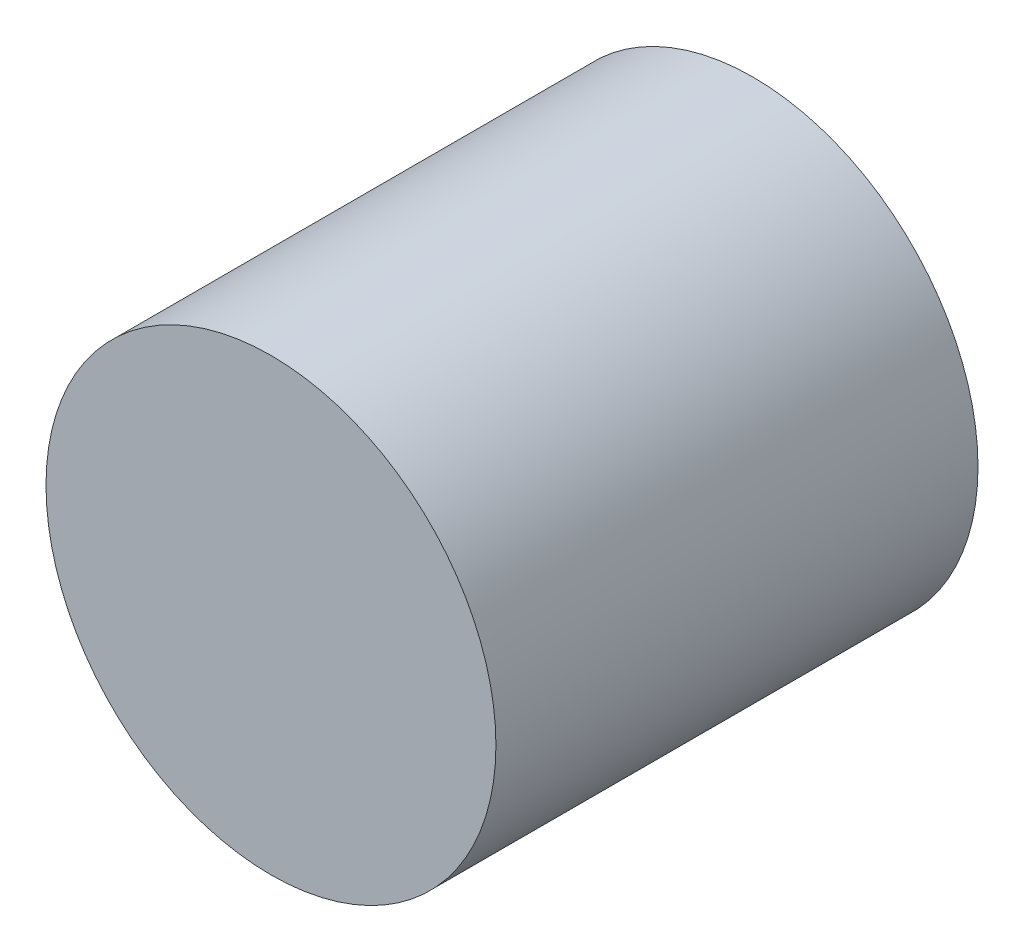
ISO-10303-21;
HEADER;
FILE_DESCRIPTION(('STEP AP214'),'2;1');
FILE_NAME('part.step','',(''),(''),'','','');
FILE_SCHEMA(('AUTOMOTIVE_DESIGN { 1 0 10303 214 1 1 1 1 }'));
ENDSEC;
DATA;
#1=APPLICATION_CONTEXT('core data for automotive mechanical design processes');
#2=APPLICATION_PROTOCOL_DEFINITION('international standard','automotive_design',2000,#1);
#3=PRODUCT_CONTEXT('',#1,'mechanical');
#4=PRODUCT('Part','Part','',(#3));
#5=PRODUCT_RELATED_PRODUCT_CATEGORY('part','',(#4));
#6=PRODUCT_DEFINITION_FORMATION('','',#4);
#7=PRODUCT_DEFINITION_CONTEXT('part definition',#1,'design');
#8=PRODUCT_DEFINITION('design','',#6,#7);
#9=PRODUCT_DEFINITION_SHAPE('','',#8);
#10=(LENGTH_UNIT() NAMED_UNIT(*) SI_UNIT(.MILLI.,.METRE.));
#11=(NAMED_UNIT(*) PLANE_ANGLE_UNIT() SI_UNIT($,.RADIAN.));
#12=(NAMED_UNIT(*) SI_UNIT($,.STERADIAN.) SOLID_ANGLE_UNIT());
#13=UNCERTAINTY_MEASURE_WITH_UNIT(LENGTH_MEASURE(1.E-05),#10,'distance_accuracy_value','');
#14=(GEOMETRIC_REPRESENTATION_CONTEXT(3) GLOBAL_UNCERTAINTY_ASSIGNED_CONTEXT((#13)) GLOBAL_UNIT_ASSIGNED_CONTEXT((#10,
#11,#12)) REPRESENTATION_CONTEXT('',''));
#15=CARTESIAN_POINT('',(0.,0.,0.));
#16=DIRECTION('',(0.,0.,1.));
#17=DIRECTION('',(1.,0.,0.));
#18=AXIS2_PLACEMENT_3D('',#15,#16,#17);
#19=CARTESIAN_POINT('',(0.,0.,7.5));
#20=DIRECTION('',(0.,0.,1.));
#21=DIRECTION('',(1.,0.,0.));
#22=AXIS2_PLACEMENT_3D('',#19,#20,#21);
#23=PLANE('',#22);
#24=CARTESIAN_POINT('',(0.,0.,7.5));
#25=DIRECTION('',(0.,0.,-1.));
#26=DIRECTION('',(-1.,0.,0.));
#27=AXIS2_PLACEMENT_3D('',#24,#25,#26);
#28=CIRCLE('',#27,7.);
#29=CARTESIAN_POINT('',(-7.,0.,7.5));
#30=VERTEX_POINT('',#29);
#31=EDGE_CURVE('E10',#30,#30,#28,.T.);
#32=ORIENTED_EDGE('',*,*,#31,.F.);
#33=EDGE_LOOP('',(#32));
#34=FACE_BOUND('',#33,.T.);
#35=ADVANCED_FACE('F15',(#34),#23,.T.);
#36=CARTESIAN_POINT('',(0.,0.,-7.5));
#37=DIRECTION('',(0.,0.,-1.));
#38=DIRECTION('',(-1.,0.,0.));
#39=AXIS2_PLACEMENT_3D('',#36,#37,#38);
#40=PLANE('',#39);
#41=CARTESIAN_POINT('',(0.,0.,-7.5));
#42=DIRECTION('',(0.,0.,1.));
#43=DIRECTION('',(1.,0.,0.));
#44=AXIS2_PLACEMENT_3D('',#41,#42,#43);
#45=CIRCLE('',#44,7.);
#46=CARTESIAN_POINT('',(7.,0.,-7.5));
#47=VERTEX_POINT('',#46);
#48=EDGE_CURVE('E22',#47,#47,#45,.T.);
#49=ORIENTED_EDGE('',*,*,#48,.F.);
#50=EDGE_LOOP('',(#49));
#51=FACE_BOUND('',#50,.T.);
#52=ADVANCED_FACE('F26',(#51),#40,.T.);
#53=CARTESIAN_POINT('',(0.,0.,-7.5));
#54=DIRECTION('',(0.,0.,1.));
#55=DIRECTION('',(1.,0.,0.));
#56=AXIS2_PLACEMENT_3D('',#53,#54,#55);
#57=CYLINDRICAL_SURFACE('',#56,7.);
#58=ORIENTED_EDGE('',*,*,#31,.T.);
#59=EDGE_LOOP('',(#58));
#60=FACE_BOUND('',#59,.T.);
#61=ORIENTED_EDGE('',*,*,#48,.T.);
#62=EDGE_LOOP('',(#61));
#63=FACE_BOUND('',#62,.T.);
#64=ADVANCED_FACE('F17',(#60,#63),#57,.T.);
#65=CLOSED_SHELL('',(#35,#52,#64));
#66=MANIFOLD_SOLID_BREP('B1',#65);
#67=ADVANCED_BREP_SHAPE_REPRESENTATION('',(#18,#66),#14);
#68=SHAPE_DEFINITION_REPRESENTATION(#9,#67);
ENDSEC;
END-ISO-10303-21;
